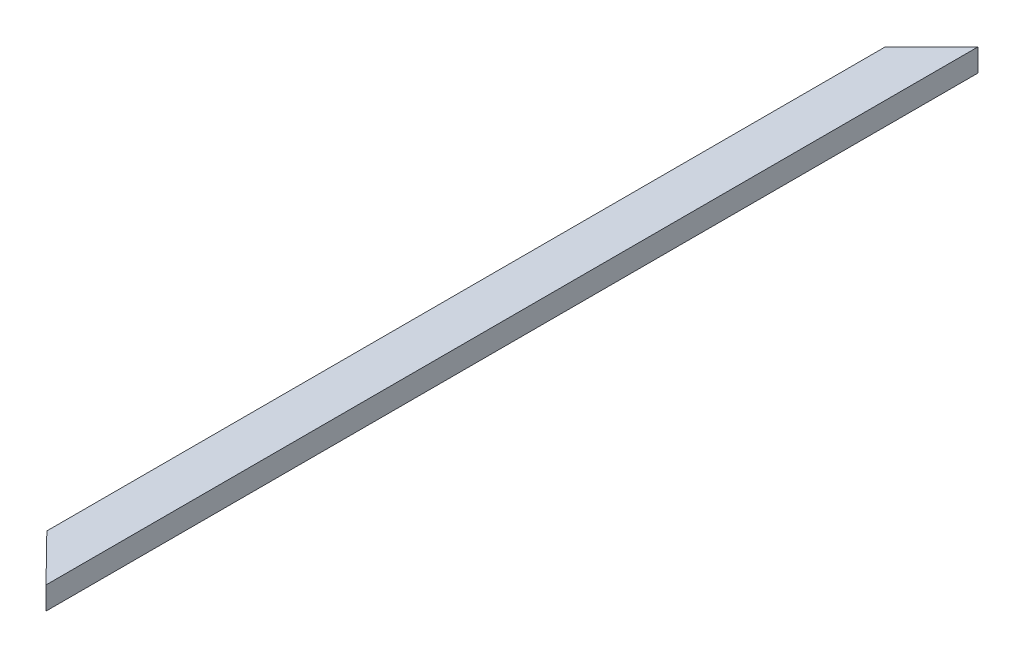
from build123d import *

# Parameters (mm, degrees)
ESQUISSE1_W        = 47
ESQUISSE1_H        = 23
BOSS_EXTRU_1_DEPTH = 850
BOSS_EXTRU_2_DEPTH = 11.5


with BuildPart() as part:
    # Esquisse1 → Boss.-Extru.1 (new body)
    with BuildSketch(Plane.XY):
        Rectangle(ESQUISSE1_W, ESQUISSE1_H)
    extrude(amount=BOSS_EXTRU_1_DEPTH)

    # Esquisse2 → Boss.-Extru.2 (add, symmetric)
    with BuildSketch(Plane(origin=(0, 0, 0), x_dir=(1, 0, 0), z_dir=(0, 1, 0))):
        Polygon((-23.5, -850), (23.5, -897.837723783), (23.5, -850), align=None)
        Polygon((-23.5, 0), (23.5, 47), (23.5, 0), align=None)
    extrude(amount=BOSS_EXTRU_2_DEPTH, both=True)


solid = part.part
